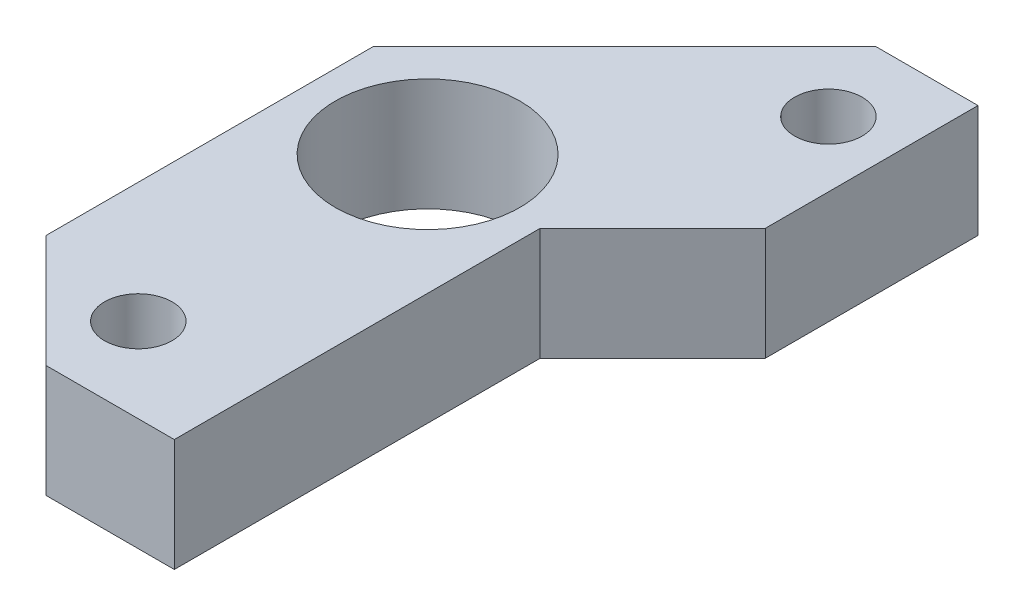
from build123d import *

# Parameters (mm, degrees)
SKETCH6_R           = 1.2
SKETCH6_R_2         = 3.28
BOSS_EXTRUDE4_DEPTH = 4


with BuildPart() as part:
    # Sketch6 → Boss-Extrude4 (new body)
    with BuildSketch(Plane(origin=(0, 0, 0), x_dir=(1, 0, 0), z_dir=(0, 1, 0))):
        Polygon((43.22, -13.28), (47.78, -13.28), (47.78, -0.28), (51.78, 3.72), (51.78, 11.28), (48.146771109, 11.28), (39.22, 2.353228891), (39.22, -9.28), align=None)
        with Locations(Location((49.463385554, 8.28, 0), (0, 0, 270))):
            Circle(SKETCH6_R, mode=Mode.SUBTRACT)
        with Locations(Location((43.5, -10.28, 0), (0, 0, 270))):
            Circle(SKETCH6_R, mode=Mode.SUBTRACT)
        with Locations(Location((43.5, 0, 0), (0, 0, 270))):
            Circle(SKETCH6_R_2, mode=Mode.SUBTRACT)
    extrude(amount=BOSS_EXTRUDE4_DEPTH)


solid = part.part
